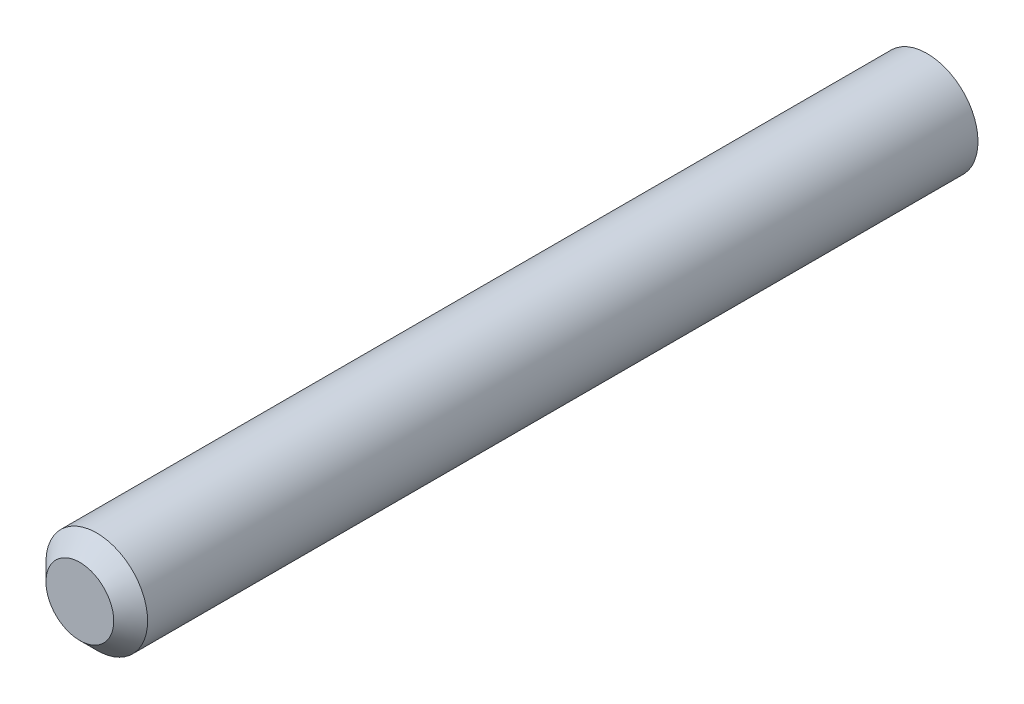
from build123d import *

# Parameters (mm, degrees)
ESQUISSE2_R      = 3
EXTRUSION1_DEPTH = 50
CHANFREIN1_SIZE  = 1


with BuildPart() as part:
    # Esquisse2 → Extrusion1 (new body)
    with BuildSketch(Plane.XY):
        Circle(ESQUISSE2_R)
    extrude(amount=EXTRUSION1_DEPTH)

    # Chanfrein1
    chanfrein1_edges = [part.edges().sort_by_distance(p)[0] for p in [
        (-3, 0, 50),
    ]]
    chamfer(chanfrein1_edges, length=CHANFREIN1_SIZE)


solid = part.part
